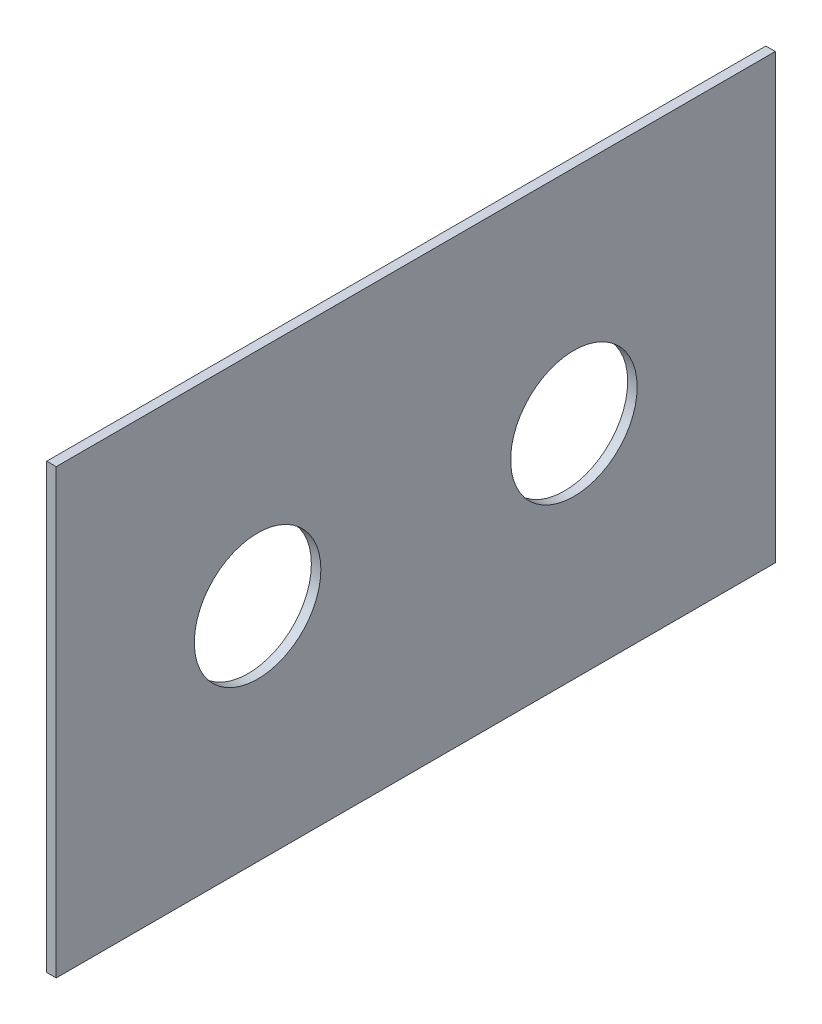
ISO-10303-21;
HEADER;
FILE_DESCRIPTION(('STEP AP214'),'2;1');
FILE_NAME('part.step','',(''),(''),'','','');
FILE_SCHEMA(('AUTOMOTIVE_DESIGN { 1 0 10303 214 1 1 1 1 }'));
ENDSEC;
DATA;
#1=APPLICATION_CONTEXT('core data for automotive mechanical design processes');
#2=APPLICATION_PROTOCOL_DEFINITION('international standard','automotive_design',2000,#1);
#3=PRODUCT_CONTEXT('',#1,'mechanical');
#4=PRODUCT('Part','Part','',(#3));
#5=PRODUCT_RELATED_PRODUCT_CATEGORY('part','',(#4));
#6=PRODUCT_DEFINITION_FORMATION('','',#4);
#7=PRODUCT_DEFINITION_CONTEXT('part definition',#1,'design');
#8=PRODUCT_DEFINITION('design','',#6,#7);
#9=PRODUCT_DEFINITION_SHAPE('','',#8);
#10=(LENGTH_UNIT() NAMED_UNIT(*) SI_UNIT(.MILLI.,.METRE.));
#11=(NAMED_UNIT(*) PLANE_ANGLE_UNIT() SI_UNIT($,.RADIAN.));
#12=(NAMED_UNIT(*) SI_UNIT($,.STERADIAN.) SOLID_ANGLE_UNIT());
#13=UNCERTAINTY_MEASURE_WITH_UNIT(LENGTH_MEASURE(1.E-05),#10,'distance_accuracy_value','');
#14=(GEOMETRIC_REPRESENTATION_CONTEXT(3) GLOBAL_UNCERTAINTY_ASSIGNED_CONTEXT((#13)) GLOBAL_UNIT_ASSIGNED_CONTEXT((#10,
#11,#12)) REPRESENTATION_CONTEXT('',''));
#15=CARTESIAN_POINT('',(0.,0.,0.));
#16=DIRECTION('',(0.,0.,1.));
#17=DIRECTION('',(1.,0.,0.));
#18=AXIS2_PLACEMENT_3D('',#15,#16,#17);
#19=CARTESIAN_POINT('',(9.,210.,-341.));
#20=DIRECTION('',(0.,0.,1.));
#21=DIRECTION('',(0.,-1.,0.));
#22=AXIS2_PLACEMENT_3D('',#19,#20,#21);
#23=PLANE('',#22);
#24=DIRECTION('',(0.,1.,0.));
#25=VECTOR('',#24,1.);
#26=CARTESIAN_POINT('',(0.,210.,-341.));
#27=LINE('',#26,#25);
#28=CARTESIAN_POINT('',(0.,-210.,-341.));
#29=VERTEX_POINT('',#28);
#30=CARTESIAN_POINT('',(0.,210.,-341.));
#31=VERTEX_POINT('',#30);
#32=EDGE_CURVE('E106',#29,#31,#27,.T.);
#33=ORIENTED_EDGE('',*,*,#32,.T.);
#34=DIRECTION('',(-1.,0.,0.));
#35=VECTOR('',#34,1.);
#36=CARTESIAN_POINT('',(9.,210.,-341.));
#37=LINE('',#36,#35);
#38=CARTESIAN_POINT('',(9.,210.,-341.));
#39=VERTEX_POINT('',#38);
#40=EDGE_CURVE('E11',#39,#31,#37,.T.);
#41=ORIENTED_EDGE('',*,*,#40,.F.);
#42=DIRECTION('',(0.,1.,0.));
#43=VECTOR('',#42,1.);
#44=CARTESIAN_POINT('',(9.,210.,-341.));
#45=LINE('',#44,#43);
#46=CARTESIAN_POINT('',(9.,-210.,-341.));
#47=VERTEX_POINT('',#46);
#48=EDGE_CURVE('E90',#47,#39,#45,.T.);
#49=ORIENTED_EDGE('',*,*,#48,.F.);
#50=DIRECTION('',(-1.,0.,0.));
#51=VECTOR('',#50,1.);
#52=CARTESIAN_POINT('',(9.,-210.,-341.));
#53=LINE('',#52,#51);
#54=EDGE_CURVE('E102',#47,#29,#53,.T.);
#55=ORIENTED_EDGE('',*,*,#54,.T.);
#56=EDGE_LOOP('',(#33,#41,#49,#55));
#57=FACE_BOUND('',#56,.T.);
#58=ADVANCED_FACE('F38',(#57),#23,.F.);
#59=CARTESIAN_POINT('',(9.,210.,341.));
#60=DIRECTION('',(0.,-1.,0.));
#61=DIRECTION('',(0.,0.,-1.));
#62=AXIS2_PLACEMENT_3D('',#59,#60,#61);
#63=PLANE('',#62);
#64=DIRECTION('',(0.,0.,1.));
#65=VECTOR('',#64,1.);
#66=CARTESIAN_POINT('',(0.,210.,341.));
#67=LINE('',#66,#65);
#68=CARTESIAN_POINT('',(0.,210.,341.));
#69=VERTEX_POINT('',#68);
#70=EDGE_CURVE('E95',#31,#69,#67,.T.);
#71=ORIENTED_EDGE('',*,*,#70,.T.);
#72=DIRECTION('',(-1.,0.,0.));
#73=VECTOR('',#72,1.);
#74=CARTESIAN_POINT('',(9.,210.,341.));
#75=LINE('',#74,#73);
#76=CARTESIAN_POINT('',(9.,210.,341.));
#77=VERTEX_POINT('',#76);
#78=EDGE_CURVE('E47',#77,#69,#75,.T.);
#79=ORIENTED_EDGE('',*,*,#78,.F.);
#80=DIRECTION('',(0.,0.,1.));
#81=VECTOR('',#80,1.);
#82=CARTESIAN_POINT('',(9.,210.,341.));
#83=LINE('',#82,#81);
#84=EDGE_CURVE('E85',#39,#77,#83,.T.);
#85=ORIENTED_EDGE('',*,*,#84,.F.);
#86=ORIENTED_EDGE('',*,*,#40,.T.);
#87=EDGE_LOOP('',(#71,#79,#85,#86));
#88=FACE_BOUND('',#87,.T.);
#89=ADVANCED_FACE('F94',(#88),#63,.F.);
#90=CARTESIAN_POINT('',(9.,210.,341.));
#91=DIRECTION('',(0.,0.,-1.));
#92=DIRECTION('',(0.,1.,0.));
#93=AXIS2_PLACEMENT_3D('',#90,#91,#92);
#94=PLANE('',#93);
#95=DIRECTION('',(0.,-1.,0.));
#96=VECTOR('',#95,1.);
#97=CARTESIAN_POINT('',(0.,210.,341.));
#98=LINE('',#97,#96);
#99=CARTESIAN_POINT('',(0.,-210.,341.));
#100=VERTEX_POINT('',#99);
#101=EDGE_CURVE('E72',#69,#100,#98,.T.);
#102=ORIENTED_EDGE('',*,*,#101,.T.);
#103=DIRECTION('',(-1.,0.,0.));
#104=VECTOR('',#103,1.);
#105=CARTESIAN_POINT('',(9.,-210.,341.));
#106=LINE('',#105,#104);
#107=CARTESIAN_POINT('',(9.,-210.,341.));
#108=VERTEX_POINT('',#107);
#109=EDGE_CURVE('E97',#108,#100,#106,.T.);
#110=ORIENTED_EDGE('',*,*,#109,.F.);
#111=DIRECTION('',(0.,-1.,0.));
#112=VECTOR('',#111,1.);
#113=CARTESIAN_POINT('',(9.,210.,341.));
#114=LINE('',#113,#112);
#115=EDGE_CURVE('E88',#77,#108,#114,.T.);
#116=ORIENTED_EDGE('',*,*,#115,.F.);
#117=ORIENTED_EDGE('',*,*,#78,.T.);
#118=EDGE_LOOP('',(#102,#110,#116,#117));
#119=FACE_BOUND('',#118,.T.);
#120=ADVANCED_FACE('F98',(#119),#94,.F.);
#121=CARTESIAN_POINT('',(9.,-210.,341.));
#122=DIRECTION('',(0.,1.,0.));
#123=DIRECTION('',(0.,0.,1.));
#124=AXIS2_PLACEMENT_3D('',#121,#122,#123);
#125=PLANE('',#124);
#126=DIRECTION('',(0.,0.,-1.));
#127=VECTOR('',#126,1.);
#128=CARTESIAN_POINT('',(0.,-210.,341.));
#129=LINE('',#128,#127);
#130=EDGE_CURVE('E78',#100,#29,#129,.T.);
#131=ORIENTED_EDGE('',*,*,#130,.T.);
#132=ORIENTED_EDGE('',*,*,#54,.F.);
#133=DIRECTION('',(0.,0.,-1.));
#134=VECTOR('',#133,1.);
#135=CARTESIAN_POINT('',(9.,-210.,341.));
#136=LINE('',#135,#134);
#137=EDGE_CURVE('E55',#108,#47,#136,.T.);
#138=ORIENTED_EDGE('',*,*,#137,.F.);
#139=ORIENTED_EDGE('',*,*,#109,.T.);
#140=EDGE_LOOP('',(#131,#132,#138,#139));
#141=FACE_BOUND('',#140,.T.);
#142=ADVANCED_FACE('F120',(#141),#125,.F.);
#143=CARTESIAN_POINT('',(9.,0.,0.));
#144=DIRECTION('',(1.,0.,0.));
#145=DIRECTION('',(0.,0.,-1.));
#146=AXIS2_PLACEMENT_3D('',#143,#144,#145);
#147=PLANE('',#146);
#148=CARTESIAN_POINT('',(9.,0.,150.));
#149=DIRECTION('',(1.,0.,0.));
#150=DIRECTION('',(0.,0.,-1.));
#151=AXIS2_PLACEMENT_3D('',#148,#149,#150);
#152=CIRCLE('',#151,60.);
#153=CARTESIAN_POINT('',(9.,0.,90.));
#154=VERTEX_POINT('',#153);
#155=EDGE_CURVE('E135',#154,#154,#152,.T.);
#156=ORIENTED_EDGE('',*,*,#155,.F.);
#157=EDGE_LOOP('',(#156));
#158=FACE_BOUND('',#157,.T.);
#159=CARTESIAN_POINT('',(9.,0.,-150.));
#160=DIRECTION('',(1.,0.,0.));
#161=DIRECTION('',(0.,0.,-1.));
#162=AXIS2_PLACEMENT_3D('',#159,#160,#161);
#163=CIRCLE('',#162,60.);
#164=CARTESIAN_POINT('',(9.,0.,-210.));
#165=VERTEX_POINT('',#164);
#166=EDGE_CURVE('E127',#165,#165,#163,.T.);
#167=ORIENTED_EDGE('',*,*,#166,.F.);
#168=EDGE_LOOP('',(#167));
#169=FACE_BOUND('',#168,.T.);
#170=ORIENTED_EDGE('',*,*,#48,.T.);
#171=ORIENTED_EDGE('',*,*,#84,.T.);
#172=ORIENTED_EDGE('',*,*,#115,.T.);
#173=ORIENTED_EDGE('',*,*,#137,.T.);
#174=EDGE_LOOP('',(#170,#171,#172,#173));
#175=FACE_BOUND('',#174,.T.);
#176=ADVANCED_FACE('F86',(#158,#169,#175),#147,.T.);
#177=CARTESIAN_POINT('',(0.,0.,0.));
#178=DIRECTION('',(1.,0.,0.));
#179=DIRECTION('',(0.,0.,-1.));
#180=AXIS2_PLACEMENT_3D('',#177,#178,#179);
#181=PLANE('',#180);
#182=CARTESIAN_POINT('',(0.,0.,150.));
#183=DIRECTION('',(1.,0.,0.));
#184=DIRECTION('',(0.,0.,-1.));
#185=AXIS2_PLACEMENT_3D('',#182,#183,#184);
#186=CIRCLE('',#185,60.);
#187=CARTESIAN_POINT('',(0.,0.,90.));
#188=VERTEX_POINT('',#187);
#189=EDGE_CURVE('E110',#188,#188,#186,.T.);
#190=ORIENTED_EDGE('',*,*,#189,.T.);
#191=EDGE_LOOP('',(#190));
#192=FACE_BOUND('',#191,.T.);
#193=CARTESIAN_POINT('',(0.,0.,-150.));
#194=DIRECTION('',(1.,0.,0.));
#195=DIRECTION('',(0.,0.,-1.));
#196=AXIS2_PLACEMENT_3D('',#193,#194,#195);
#197=CIRCLE('',#196,60.);
#198=CARTESIAN_POINT('',(0.,0.,-210.));
#199=VERTEX_POINT('',#198);
#200=EDGE_CURVE('E131',#199,#199,#197,.T.);
#201=ORIENTED_EDGE('',*,*,#200,.T.);
#202=EDGE_LOOP('',(#201));
#203=FACE_BOUND('',#202,.T.);
#204=ORIENTED_EDGE('',*,*,#32,.F.);
#205=ORIENTED_EDGE('',*,*,#130,.F.);
#206=ORIENTED_EDGE('',*,*,#101,.F.);
#207=ORIENTED_EDGE('',*,*,#70,.F.);
#208=EDGE_LOOP('',(#204,#205,#206,#207));
#209=FACE_BOUND('',#208,.T.);
#210=ADVANCED_FACE('F123',(#192,#203,#209),#181,.F.);
#211=CARTESIAN_POINT('',(0.,0.,-150.));
#212=DIRECTION('',(1.,0.,0.));
#213=DIRECTION('',(0.,0.,-1.));
#214=AXIS2_PLACEMENT_3D('',#211,#212,#213);
#215=CYLINDRICAL_SURFACE('',#214,60.);
#216=ORIENTED_EDGE('',*,*,#200,.F.);
#217=EDGE_LOOP('',(#216));
#218=FACE_BOUND('',#217,.T.);
#219=ORIENTED_EDGE('',*,*,#166,.T.);
#220=EDGE_LOOP('',(#219));
#221=FACE_BOUND('',#220,.T.);
#222=ADVANCED_FACE('F148',(#218,#221),#215,.F.);
#223=CARTESIAN_POINT('',(0.,0.,150.));
#224=DIRECTION('',(1.,0.,0.));
#225=DIRECTION('',(0.,0.,-1.));
#226=AXIS2_PLACEMENT_3D('',#223,#224,#225);
#227=CYLINDRICAL_SURFACE('',#226,60.);
#228=ORIENTED_EDGE('',*,*,#189,.F.);
#229=EDGE_LOOP('',(#228));
#230=FACE_BOUND('',#229,.T.);
#231=ORIENTED_EDGE('',*,*,#155,.T.);
#232=EDGE_LOOP('',(#231));
#233=FACE_BOUND('',#232,.T.);
#234=ADVANCED_FACE('F145',(#230,#233),#227,.F.);
#235=CLOSED_SHELL('',(#58,#89,#120,#142,#176,#210,#222,#234));
#236=MANIFOLD_SOLID_BREP('B2',#235);
#237=ADVANCED_BREP_SHAPE_REPRESENTATION('',(#18,#236),#14);
#238=SHAPE_DEFINITION_REPRESENTATION(#9,#237);
ENDSEC;
END-ISO-10303-21;
